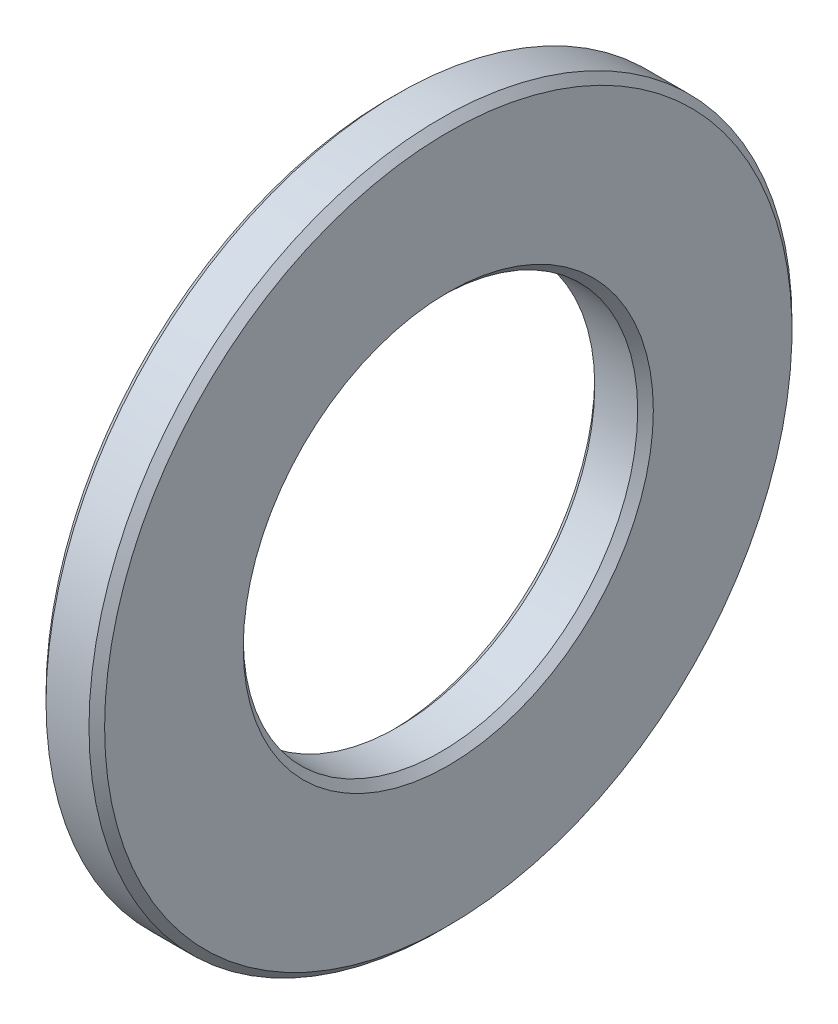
from build123d import *


with BuildPart() as part:
    # Esquisse1 → R_volution1 (revolve)
    with BuildSketch(Plane.XY, mode=Mode.PRIVATE) as r_volution1_sk:
        Polygon((0, 8.8), (0.2, 9), (1.3, 9), (1.5, 8.8), (1.5, 5.25), (1.3, 5.05), (0.2, 5.05), (0, 5.25), align=None)
    revolve(r_volution1_sk.sketch.rotate(Axis((0, 0, 0), (1, 0, 0)), 90), axis=Axis((0, 0, 0), (1, 0, 0)))


solid = part.part
